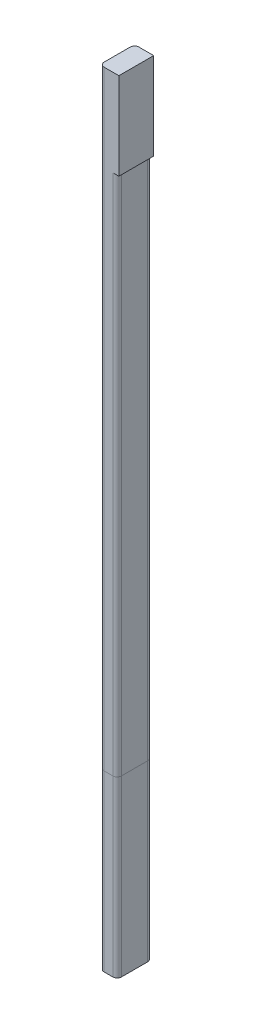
ISO-10303-21;
HEADER;
FILE_DESCRIPTION(('STEP AP214'),'2;1');
FILE_NAME('part.step','',(''),(''),'','','');
FILE_SCHEMA(('AUTOMOTIVE_DESIGN { 1 0 10303 214 1 1 1 1 }'));
ENDSEC;
DATA;
#1=APPLICATION_CONTEXT('core data for automotive mechanical design processes');
#2=APPLICATION_PROTOCOL_DEFINITION('international standard','automotive_design',2000,#1);
#3=PRODUCT_CONTEXT('',#1,'mechanical');
#4=PRODUCT('Part','Part','',(#3));
#5=PRODUCT_RELATED_PRODUCT_CATEGORY('part','',(#4));
#6=PRODUCT_DEFINITION_FORMATION('','',#4);
#7=PRODUCT_DEFINITION_CONTEXT('part definition',#1,'design');
#8=PRODUCT_DEFINITION('design','',#6,#7);
#9=PRODUCT_DEFINITION_SHAPE('','',#8);
#10=(LENGTH_UNIT() NAMED_UNIT(*) SI_UNIT(.MILLI.,.METRE.));
#11=(NAMED_UNIT(*) PLANE_ANGLE_UNIT() SI_UNIT($,.RADIAN.));
#12=(NAMED_UNIT(*) SI_UNIT($,.STERADIAN.) SOLID_ANGLE_UNIT());
#13=UNCERTAINTY_MEASURE_WITH_UNIT(LENGTH_MEASURE(1.E-05),#10,'distance_accuracy_value','');
#14=(GEOMETRIC_REPRESENTATION_CONTEXT(3) GLOBAL_UNCERTAINTY_ASSIGNED_CONTEXT((#13)) GLOBAL_UNIT_ASSIGNED_CONTEXT((#10,
#11,#12)) REPRESENTATION_CONTEXT('',''));
#15=CARTESIAN_POINT('',(0.,0.,0.));
#16=DIRECTION('',(0.,0.,1.));
#17=DIRECTION('',(1.,0.,0.));
#18=AXIS2_PLACEMENT_3D('',#15,#16,#17);
#19=CARTESIAN_POINT('',(0.,0.,0.));
#20=DIRECTION('',(0.,-1.,0.));
#21=DIRECTION('',(0.,0.,-1.));
#22=AXIS2_PLACEMENT_3D('',#19,#20,#21);
#23=PLANE('',#22);
#24=DIRECTION('',(0.,0.,1.));
#25=VECTOR('',#24,1.);
#26=CARTESIAN_POINT('',(1.,0.,-1.5));
#27=LINE('',#26,#25);
#28=CARTESIAN_POINT('',(1.,0.,-1.5));
#29=VERTEX_POINT('',#28);
#30=CARTESIAN_POINT('',(1.,0.,1.5));
#31=VERTEX_POINT('',#30);
#32=EDGE_CURVE('E212',#29,#31,#27,.T.);
#33=ORIENTED_EDGE('',*,*,#32,.T.);
#34=CARTESIAN_POINT('',(0.5,0.,1.5));
#35=DIRECTION('',(0.,-1.,0.));
#36=DIRECTION('',(0.,0.,-1.));
#37=AXIS2_PLACEMENT_3D('',#34,#35,#36);
#38=CIRCLE('',#37,0.5);
#39=CARTESIAN_POINT('',(0.5,0.,2.));
#40=VERTEX_POINT('',#39);
#41=EDGE_CURVE('E228',#31,#40,#38,.T.);
#42=ORIENTED_EDGE('',*,*,#41,.T.);
#43=DIRECTION('',(-1.,0.,0.));
#44=VECTOR('',#43,1.);
#45=CARTESIAN_POINT('',(0.5,0.,2.));
#46=LINE('',#45,#44);
#47=CARTESIAN_POINT('',(-0.5,0.,2.));
#48=VERTEX_POINT('',#47);
#49=EDGE_CURVE('E194',#40,#48,#46,.T.);
#50=ORIENTED_EDGE('',*,*,#49,.T.);
#51=CARTESIAN_POINT('',(-0.5,0.,1.5));
#52=DIRECTION('',(0.,-1.,0.));
#53=DIRECTION('',(0.,0.,-1.));
#54=AXIS2_PLACEMENT_3D('',#51,#52,#53);
#55=CIRCLE('',#54,0.5);
#56=CARTESIAN_POINT('',(-1.,0.,1.5));
#57=VERTEX_POINT('',#56);
#58=EDGE_CURVE('E226',#48,#57,#55,.T.);
#59=ORIENTED_EDGE('',*,*,#58,.T.);
#60=DIRECTION('',(0.,0.,-1.));
#61=VECTOR('',#60,1.);
#62=CARTESIAN_POINT('',(-1.,0.,-1.5));
#63=LINE('',#62,#61);
#64=CARTESIAN_POINT('',(-1.,0.,-1.5));
#65=VERTEX_POINT('',#64);
#66=EDGE_CURVE('E352',#57,#65,#63,.T.);
#67=ORIENTED_EDGE('',*,*,#66,.T.);
#68=CARTESIAN_POINT('',(-0.5,0.,-1.5));
#69=DIRECTION('',(0.,-1.,0.));
#70=DIRECTION('',(0.,0.,-1.));
#71=AXIS2_PLACEMENT_3D('',#68,#69,#70);
#72=CIRCLE('',#71,0.5);
#73=CARTESIAN_POINT('',(-0.5,0.,-2.));
#74=VERTEX_POINT('',#73);
#75=EDGE_CURVE('E222',#65,#74,#72,.T.);
#76=ORIENTED_EDGE('',*,*,#75,.T.);
#77=DIRECTION('',(1.,0.,0.));
#78=VECTOR('',#77,1.);
#79=CARTESIAN_POINT('',(0.5,0.,-2.));
#80=LINE('',#79,#78);
#81=CARTESIAN_POINT('',(0.5,0.,-2.));
#82=VERTEX_POINT('',#81);
#83=EDGE_CURVE('E213',#74,#82,#80,.T.);
#84=ORIENTED_EDGE('',*,*,#83,.T.);
#85=CARTESIAN_POINT('',(0.5,0.,-1.5));
#86=DIRECTION('',(0.,-1.,0.));
#87=DIRECTION('',(0.,0.,-1.));
#88=AXIS2_PLACEMENT_3D('',#85,#86,#87);
#89=CIRCLE('',#88,0.5);
#90=EDGE_CURVE('E224',#82,#29,#89,.T.);
#91=ORIENTED_EDGE('',*,*,#90,.T.);
#92=EDGE_LOOP('',(#33,#42,#50,#59,#67,#76,#84,#91));
#93=FACE_BOUND('',#92,.T.);
#94=ADVANCED_FACE('F73',(#93),#23,.T.);
#95=CARTESIAN_POINT('',(0.,20.,0.));
#96=DIRECTION('',(0.,-1.,0.));
#97=DIRECTION('',(0.,0.,-1.));
#98=AXIS2_PLACEMENT_3D('',#95,#96,#97);
#99=PLANE('',#98);
#100=DIRECTION('',(-1.,0.,0.));
#101=VECTOR('',#100,1.);
#102=CARTESIAN_POINT('',(0.5,20.,2.));
#103=LINE('',#102,#101);
#104=CARTESIAN_POINT('',(0.5,20.,2.));
#105=VERTEX_POINT('',#104);
#106=CARTESIAN_POINT('',(-0.5,20.,2.));
#107=VERTEX_POINT('',#106);
#108=EDGE_CURVE('E191',#105,#107,#103,.T.);
#109=ORIENTED_EDGE('',*,*,#108,.F.);
#110=CARTESIAN_POINT('',(0.5,20.,1.5));
#111=DIRECTION('',(0.,-1.,0.));
#112=DIRECTION('',(0.,0.,-1.));
#113=AXIS2_PLACEMENT_3D('',#110,#111,#112);
#114=CIRCLE('',#113,0.5);
#115=CARTESIAN_POINT('',(1.,20.,1.5));
#116=VERTEX_POINT('',#115);
#117=EDGE_CURVE('E174',#105,#116,#114,.F.);
#118=ORIENTED_EDGE('',*,*,#117,.T.);
#119=DIRECTION('',(0.,0.,1.));
#120=VECTOR('',#119,1.);
#121=CARTESIAN_POINT('',(1.,20.,-1.5));
#122=LINE('',#121,#120);
#123=CARTESIAN_POINT('',(1.,20.,-1.5));
#124=VERTEX_POINT('',#123);
#125=EDGE_CURVE('E201',#124,#116,#122,.T.);
#126=ORIENTED_EDGE('',*,*,#125,.F.);
#127=CARTESIAN_POINT('',(0.5,20.,-1.5));
#128=DIRECTION('',(0.,-1.,0.));
#129=DIRECTION('',(0.,0.,-1.));
#130=AXIS2_PLACEMENT_3D('',#127,#128,#129);
#131=CIRCLE('',#130,0.5);
#132=CARTESIAN_POINT('',(0.5,20.,-2.));
#133=VERTEX_POINT('',#132);
#134=EDGE_CURVE('E216',#124,#133,#131,.F.);
#135=ORIENTED_EDGE('',*,*,#134,.T.);
#136=DIRECTION('',(1.,0.,0.));
#137=VECTOR('',#136,1.);
#138=CARTESIAN_POINT('',(0.5,20.,-2.));
#139=LINE('',#138,#137);
#140=CARTESIAN_POINT('',(-0.5,20.,-2.));
#141=VERTEX_POINT('',#140);
#142=EDGE_CURVE('E204',#141,#133,#139,.T.);
#143=ORIENTED_EDGE('',*,*,#142,.F.);
#144=CARTESIAN_POINT('',(-0.5,20.,-1.5));
#145=DIRECTION('',(0.,-1.,0.));
#146=DIRECTION('',(0.,0.,-1.));
#147=AXIS2_PLACEMENT_3D('',#144,#145,#146);
#148=CIRCLE('',#147,0.5);
#149=CARTESIAN_POINT('',(-1.,20.,-1.5));
#150=VERTEX_POINT('',#149);
#151=EDGE_CURVE('E195',#141,#150,#148,.F.);
#152=ORIENTED_EDGE('',*,*,#151,.T.);
#153=DIRECTION('',(0.,0.,-1.));
#154=VECTOR('',#153,1.);
#155=CARTESIAN_POINT('',(-1.,20.,-1.5));
#156=LINE('',#155,#154);
#157=CARTESIAN_POINT('',(-1.,20.,1.5));
#158=VERTEX_POINT('',#157);
#159=EDGE_CURVE('E200',#158,#150,#156,.T.);
#160=ORIENTED_EDGE('',*,*,#159,.F.);
#161=CARTESIAN_POINT('',(-0.5,20.,1.5));
#162=DIRECTION('',(0.,-1.,0.));
#163=DIRECTION('',(0.,0.,-1.));
#164=AXIS2_PLACEMENT_3D('',#161,#162,#163);
#165=CIRCLE('',#164,0.5);
#166=EDGE_CURVE('E185',#158,#107,#165,.F.);
#167=ORIENTED_EDGE('',*,*,#166,.T.);
#168=EDGE_LOOP('',(#109,#118,#126,#135,#143,#152,#160,#167));
#169=FACE_BOUND('',#168,.T.);
#170=DIRECTION('',(0.,0.,-1.));
#171=VECTOR('',#170,1.);
#172=CARTESIAN_POINT('',(-0.5,20.,-1.5));
#173=LINE('',#172,#171);
#174=CARTESIAN_POINT('',(-0.5,20.,1.));
#175=VERTEX_POINT('',#174);
#176=CARTESIAN_POINT('',(-0.5,20.,-1.));
#177=VERTEX_POINT('',#176);
#178=EDGE_CURVE('E206',#175,#177,#173,.T.);
#179=ORIENTED_EDGE('',*,*,#178,.T.);
#180=CARTESIAN_POINT('',(0.,20.,-1.));
#181=DIRECTION('',(0.,-1.,0.));
#182=DIRECTION('',(0.,0.,-1.));
#183=AXIS2_PLACEMENT_3D('',#180,#181,#182);
#184=CIRCLE('',#183,0.5);
#185=CARTESIAN_POINT('',(0.,20.,-1.5));
#186=VERTEX_POINT('',#185);
#187=EDGE_CURVE('E13',#177,#186,#184,.T.);
#188=ORIENTED_EDGE('',*,*,#187,.T.);
#189=CARTESIAN_POINT('',(0.,20.,-1.));
#190=DIRECTION('',(0.,-1.,0.));
#191=DIRECTION('',(0.,0.,-1.));
#192=AXIS2_PLACEMENT_3D('',#189,#190,#191);
#193=CIRCLE('',#192,0.5);
#194=CARTESIAN_POINT('',(0.5,20.,-1.));
#195=VERTEX_POINT('',#194);
#196=EDGE_CURVE('E259',#186,#195,#193,.T.);
#197=ORIENTED_EDGE('',*,*,#196,.T.);
#198=DIRECTION('',(0.,0.,1.));
#199=VECTOR('',#198,1.);
#200=CARTESIAN_POINT('',(0.5,20.,-1.5));
#201=LINE('',#200,#199);
#202=CARTESIAN_POINT('',(0.5,20.,1.));
#203=VERTEX_POINT('',#202);
#204=EDGE_CURVE('E294',#195,#203,#201,.T.);
#205=ORIENTED_EDGE('',*,*,#204,.T.);
#206=CARTESIAN_POINT('',(0.,20.,1.));
#207=DIRECTION('',(0.,-1.,0.));
#208=DIRECTION('',(0.,0.,-1.));
#209=AXIS2_PLACEMENT_3D('',#206,#207,#208);
#210=CIRCLE('',#209,0.5);
#211=CARTESIAN_POINT('',(0.,20.,1.5));
#212=VERTEX_POINT('',#211);
#213=EDGE_CURVE('E95',#203,#212,#210,.T.);
#214=ORIENTED_EDGE('',*,*,#213,.T.);
#215=CARTESIAN_POINT('',(0.,20.,1.));
#216=DIRECTION('',(0.,-1.,0.));
#217=DIRECTION('',(0.,0.,-1.));
#218=AXIS2_PLACEMENT_3D('',#215,#216,#217);
#219=CIRCLE('',#218,0.5);
#220=EDGE_CURVE('E82',#212,#175,#219,.T.);
#221=ORIENTED_EDGE('',*,*,#220,.T.);
#222=EDGE_LOOP('',(#179,#188,#197,#205,#214,#221));
#223=FACE_BOUND('',#222,.T.);
#224=ADVANCED_FACE('F198',(#169,#223),#99,.F.);
#225=CARTESIAN_POINT('',(1.,0.,-1.5));
#226=DIRECTION('',(-1.,0.,0.));
#227=DIRECTION('',(0.,0.,1.));
#228=AXIS2_PLACEMENT_3D('',#225,#226,#227);
#229=PLANE('',#228);
#230=ORIENTED_EDGE('',*,*,#125,.T.);
#231=DIRECTION('',(0.,1.,0.));
#232=VECTOR('',#231,1.);
#233=CARTESIAN_POINT('',(1.,0.,1.5));
#234=LINE('',#233,#232);
#235=EDGE_CURVE('E179',#116,#31,#234,.F.);
#236=ORIENTED_EDGE('',*,*,#235,.T.);
#237=ORIENTED_EDGE('',*,*,#32,.F.);
#238=DIRECTION('',(0.,1.,0.));
#239=VECTOR('',#238,1.);
#240=CARTESIAN_POINT('',(1.,0.,-1.5));
#241=LINE('',#240,#239);
#242=EDGE_CURVE('E184',#29,#124,#241,.T.);
#243=ORIENTED_EDGE('',*,*,#242,.T.);
#244=EDGE_LOOP('',(#230,#236,#237,#243));
#245=FACE_BOUND('',#244,.T.);
#246=ADVANCED_FACE('F312',(#245),#229,.F.);
#247=CARTESIAN_POINT('',(0.5,0.,2.));
#248=DIRECTION('',(0.,0.,-1.));
#249=DIRECTION('',(-1.,0.,0.));
#250=AXIS2_PLACEMENT_3D('',#247,#248,#249);
#251=PLANE('',#250);
#252=ORIENTED_EDGE('',*,*,#49,.F.);
#253=DIRECTION('',(0.,1.,0.));
#254=VECTOR('',#253,1.);
#255=CARTESIAN_POINT('',(0.5,0.,2.));
#256=LINE('',#255,#254);
#257=EDGE_CURVE('E178',#40,#105,#256,.T.);
#258=ORIENTED_EDGE('',*,*,#257,.T.);
#259=ORIENTED_EDGE('',*,*,#108,.T.);
#260=DIRECTION('',(0.,1.,0.));
#261=VECTOR('',#260,1.);
#262=CARTESIAN_POINT('',(-0.5,0.,2.));
#263=LINE('',#262,#261);
#264=EDGE_CURVE('E196',#107,#48,#263,.F.);
#265=ORIENTED_EDGE('',*,*,#264,.T.);
#266=EDGE_LOOP('',(#252,#258,#259,#265));
#267=FACE_BOUND('',#266,.T.);
#268=ADVANCED_FACE('F190',(#267),#251,.F.);
#269=CARTESIAN_POINT('',(-1.,0.,-1.5));
#270=DIRECTION('',(1.,0.,0.));
#271=DIRECTION('',(0.,0.,-1.));
#272=AXIS2_PLACEMENT_3D('',#269,#270,#271);
#273=PLANE('',#272);
#274=ORIENTED_EDGE('',*,*,#66,.F.);
#275=DIRECTION('',(0.,1.,0.));
#276=VECTOR('',#275,1.);
#277=CARTESIAN_POINT('',(-1.,0.,1.5));
#278=LINE('',#277,#276);
#279=EDGE_CURVE('E232',#57,#158,#278,.T.);
#280=ORIENTED_EDGE('',*,*,#279,.T.);
#281=ORIENTED_EDGE('',*,*,#159,.T.);
#282=DIRECTION('',(0.,1.,0.));
#283=VECTOR('',#282,1.);
#284=CARTESIAN_POINT('',(-1.,0.,-1.5));
#285=LINE('',#284,#283);
#286=EDGE_CURVE('E230',#150,#65,#285,.F.);
#287=ORIENTED_EDGE('',*,*,#286,.T.);
#288=EDGE_LOOP('',(#274,#280,#281,#287));
#289=FACE_BOUND('',#288,.T.);
#290=ADVANCED_FACE('F321',(#289),#273,.F.);
#291=CARTESIAN_POINT('',(0.5,0.,-2.));
#292=DIRECTION('',(0.,0.,1.));
#293=DIRECTION('',(1.,0.,0.));
#294=AXIS2_PLACEMENT_3D('',#291,#292,#293);
#295=PLANE('',#294);
#296=ORIENTED_EDGE('',*,*,#142,.T.);
#297=DIRECTION('',(0.,1.,0.));
#298=VECTOR('',#297,1.);
#299=CARTESIAN_POINT('',(0.5,0.,-2.));
#300=LINE('',#299,#298);
#301=EDGE_CURVE('E238',#133,#82,#300,.F.);
#302=ORIENTED_EDGE('',*,*,#301,.T.);
#303=ORIENTED_EDGE('',*,*,#83,.F.);
#304=DIRECTION('',(0.,1.,0.));
#305=VECTOR('',#304,1.);
#306=CARTESIAN_POINT('',(-0.5,0.,-2.));
#307=LINE('',#306,#305);
#308=EDGE_CURVE('E235',#74,#141,#307,.T.);
#309=ORIENTED_EDGE('',*,*,#308,.T.);
#310=EDGE_LOOP('',(#296,#302,#303,#309));
#311=FACE_BOUND('',#310,.T.);
#312=ADVANCED_FACE('F318',(#311),#295,.F.);
#313=CARTESIAN_POINT('',(0.5,0.,-1.5));
#314=DIRECTION('',(-1.,0.,0.));
#315=DIRECTION('',(0.,0.,1.));
#316=AXIS2_PLACEMENT_3D('',#313,#314,#315);
#317=PLANE('',#316);
#318=DIRECTION('',(0.,0.,1.));
#319=VECTOR('',#318,1.);
#320=CARTESIAN_POINT('',(0.5,0.5,-1.5));
#321=LINE('',#320,#319);
#322=CARTESIAN_POINT('',(0.5,0.5,-1.));
#323=VERTEX_POINT('',#322);
#324=CARTESIAN_POINT('',(0.5,0.5,1.));
#325=VERTEX_POINT('',#324);
#326=EDGE_CURVE('E268',#323,#325,#321,.T.);
#327=ORIENTED_EDGE('',*,*,#326,.T.);
#328=DIRECTION('',(0.,1.,0.));
#329=VECTOR('',#328,1.);
#330=CARTESIAN_POINT('',(0.5,20.,1.));
#331=LINE('',#330,#329);
#332=EDGE_CURVE('E243',#325,#203,#331,.T.);
#333=ORIENTED_EDGE('',*,*,#332,.T.);
#334=ORIENTED_EDGE('',*,*,#204,.F.);
#335=DIRECTION('',(0.,1.,0.));
#336=VECTOR('',#335,1.);
#337=CARTESIAN_POINT('',(0.5,0.5,-1.));
#338=LINE('',#337,#336);
#339=EDGE_CURVE('E240',#195,#323,#338,.F.);
#340=ORIENTED_EDGE('',*,*,#339,.T.);
#341=EDGE_LOOP('',(#327,#333,#334,#340));
#342=FACE_BOUND('',#341,.T.);
#343=ADVANCED_FACE('F292',(#342),#317,.T.);
#344=CARTESIAN_POINT('',(-0.5,0.,-1.5));
#345=DIRECTION('',(1.,0.,0.));
#346=DIRECTION('',(0.,0.,-1.));
#347=AXIS2_PLACEMENT_3D('',#344,#345,#346);
#348=PLANE('',#347);
#349=ORIENTED_EDGE('',*,*,#178,.F.);
#350=DIRECTION('',(0.,1.,0.));
#351=VECTOR('',#350,1.);
#352=CARTESIAN_POINT('',(-0.5,0.5,1.));
#353=LINE('',#352,#351);
#354=CARTESIAN_POINT('',(-0.5,0.5,1.));
#355=VERTEX_POINT('',#354);
#356=EDGE_CURVE('E256',#175,#355,#353,.F.);
#357=ORIENTED_EDGE('',*,*,#356,.T.);
#358=DIRECTION('',(0.,0.,-1.));
#359=VECTOR('',#358,1.);
#360=CARTESIAN_POINT('',(-0.5,0.5,-1.5));
#361=LINE('',#360,#359);
#362=CARTESIAN_POINT('',(-0.5,0.5,-1.));
#363=VERTEX_POINT('',#362);
#364=EDGE_CURVE('E263',#355,#363,#361,.T.);
#365=ORIENTED_EDGE('',*,*,#364,.T.);
#366=DIRECTION('',(0.,1.,0.));
#367=VECTOR('',#366,1.);
#368=CARTESIAN_POINT('',(-0.5,20.,-1.));
#369=LINE('',#368,#367);
#370=EDGE_CURVE('E254',#363,#177,#369,.T.);
#371=ORIENTED_EDGE('',*,*,#370,.T.);
#372=EDGE_LOOP('',(#349,#357,#365,#371));
#373=FACE_BOUND('',#372,.T.);
#374=ADVANCED_FACE('F285',(#373),#348,.T.);
#375=CARTESIAN_POINT('',(0.,0.5,0.));
#376=DIRECTION('',(0.,1.,0.));
#377=DIRECTION('',(0.,0.,1.));
#378=AXIS2_PLACEMENT_3D('',#375,#376,#377);
#379=PLANE('',#378);
#380=CARTESIAN_POINT('',(0.,0.5,1.));
#381=DIRECTION('',(0.,1.,0.));
#382=DIRECTION('',(0.,0.,1.));
#383=AXIS2_PLACEMENT_3D('',#380,#381,#382);
#384=CIRCLE('',#383,0.5);
#385=CARTESIAN_POINT('',(0.,0.5,1.5));
#386=VERTEX_POINT('',#385);
#387=EDGE_CURVE('E250',#355,#386,#384,.T.);
#388=ORIENTED_EDGE('',*,*,#387,.T.);
#389=CARTESIAN_POINT('',(0.,0.5,1.));
#390=DIRECTION('',(0.,1.,0.));
#391=DIRECTION('',(0.,0.,1.));
#392=AXIS2_PLACEMENT_3D('',#389,#390,#391);
#393=CIRCLE('',#392,0.5);
#394=EDGE_CURVE('E252',#386,#325,#393,.T.);
#395=ORIENTED_EDGE('',*,*,#394,.T.);
#396=ORIENTED_EDGE('',*,*,#326,.F.);
#397=CARTESIAN_POINT('',(0.,0.5,-1.));
#398=DIRECTION('',(0.,1.,0.));
#399=DIRECTION('',(0.,0.,1.));
#400=AXIS2_PLACEMENT_3D('',#397,#398,#399);
#401=CIRCLE('',#400,0.5);
#402=CARTESIAN_POINT('',(0.,0.5,-1.5));
#403=VERTEX_POINT('',#402);
#404=EDGE_CURVE('E248',#323,#403,#401,.T.);
#405=ORIENTED_EDGE('',*,*,#404,.T.);
#406=CARTESIAN_POINT('',(0.,0.5,-1.));
#407=DIRECTION('',(0.,1.,0.));
#408=DIRECTION('',(0.,0.,1.));
#409=AXIS2_PLACEMENT_3D('',#406,#407,#408);
#410=CIRCLE('',#409,0.5);
#411=EDGE_CURVE('E246',#403,#363,#410,.T.);
#412=ORIENTED_EDGE('',*,*,#411,.T.);
#413=ORIENTED_EDGE('',*,*,#364,.F.);
#414=EDGE_LOOP('',(#388,#395,#396,#405,#412,#413));
#415=FACE_BOUND('',#414,.T.);
#416=ADVANCED_FACE('F280',(#415),#379,.T.);
#417=CARTESIAN_POINT('',(0.5,0.,1.5));
#418=DIRECTION('',(0.,1.,0.));
#419=DIRECTION('',(0.,0.,1.));
#420=AXIS2_PLACEMENT_3D('',#417,#418,#419);
#421=CYLINDRICAL_SURFACE('',#420,0.5);
#422=ORIENTED_EDGE('',*,*,#41,.F.);
#423=ORIENTED_EDGE('',*,*,#235,.F.);
#424=ORIENTED_EDGE('',*,*,#117,.F.);
#425=ORIENTED_EDGE('',*,*,#257,.F.);
#426=EDGE_LOOP('',(#422,#423,#424,#425));
#427=FACE_BOUND('',#426,.T.);
#428=ADVANCED_FACE('F177',(#427),#421,.T.);
#429=CARTESIAN_POINT('',(-0.5,0.,1.5));
#430=DIRECTION('',(0.,1.,0.));
#431=DIRECTION('',(0.,0.,1.));
#432=AXIS2_PLACEMENT_3D('',#429,#430,#431);
#433=CYLINDRICAL_SURFACE('',#432,0.5);
#434=ORIENTED_EDGE('',*,*,#58,.F.);
#435=ORIENTED_EDGE('',*,*,#264,.F.);
#436=ORIENTED_EDGE('',*,*,#166,.F.);
#437=ORIENTED_EDGE('',*,*,#279,.F.);
#438=EDGE_LOOP('',(#434,#435,#436,#437));
#439=FACE_BOUND('',#438,.T.);
#440=ADVANCED_FACE('F333',(#439),#433,.T.);
#441=CARTESIAN_POINT('',(0.5,0.,-1.5));
#442=DIRECTION('',(0.,1.,0.));
#443=DIRECTION('',(0.,0.,1.));
#444=AXIS2_PLACEMENT_3D('',#441,#442,#443);
#445=CYLINDRICAL_SURFACE('',#444,0.5);
#446=ORIENTED_EDGE('',*,*,#90,.F.);
#447=ORIENTED_EDGE('',*,*,#301,.F.);
#448=ORIENTED_EDGE('',*,*,#134,.F.);
#449=ORIENTED_EDGE('',*,*,#242,.F.);
#450=EDGE_LOOP('',(#446,#447,#448,#449));
#451=FACE_BOUND('',#450,.T.);
#452=ADVANCED_FACE('F336',(#451),#445,.T.);
#453=CARTESIAN_POINT('',(-0.5,0.,-1.5));
#454=DIRECTION('',(0.,1.,0.));
#455=DIRECTION('',(0.,0.,1.));
#456=AXIS2_PLACEMENT_3D('',#453,#454,#455);
#457=CYLINDRICAL_SURFACE('',#456,0.5);
#458=ORIENTED_EDGE('',*,*,#75,.F.);
#459=ORIENTED_EDGE('',*,*,#286,.F.);
#460=ORIENTED_EDGE('',*,*,#151,.F.);
#461=ORIENTED_EDGE('',*,*,#308,.F.);
#462=EDGE_LOOP('',(#458,#459,#460,#461));
#463=FACE_BOUND('',#462,.T.);
#464=ADVANCED_FACE('F303',(#463),#457,.T.);
#465=CARTESIAN_POINT('',(0.,0.,1.));
#466=DIRECTION('',(0.,-1.,0.));
#467=DIRECTION('',(0.,0.,-1.));
#468=AXIS2_PLACEMENT_3D('',#465,#466,#467);
#469=CYLINDRICAL_SURFACE('',#468,0.5);
#470=DIRECTION('',(0.,1.,0.));
#471=VECTOR('',#470,1.);
#472=CARTESIAN_POINT('',(0.,20.,1.5));
#473=LINE('',#472,#471);
#474=EDGE_CURVE('E261',#386,#212,#473,.T.);
#475=ORIENTED_EDGE('',*,*,#474,.F.);
#476=ORIENTED_EDGE('',*,*,#387,.F.);
#477=ORIENTED_EDGE('',*,*,#356,.F.);
#478=ORIENTED_EDGE('',*,*,#220,.F.);
#479=EDGE_LOOP('',(#475,#476,#477,#478));
#480=FACE_BOUND('',#479,.T.);
#481=ADVANCED_FACE('F288',(#480),#469,.F.);
#482=CARTESIAN_POINT('',(0.,0.,1.));
#483=DIRECTION('',(0.,-1.,0.));
#484=DIRECTION('',(0.,0.,-1.));
#485=AXIS2_PLACEMENT_3D('',#482,#483,#484);
#486=CYLINDRICAL_SURFACE('',#485,0.5);
#487=ORIENTED_EDGE('',*,*,#394,.F.);
#488=ORIENTED_EDGE('',*,*,#474,.T.);
#489=ORIENTED_EDGE('',*,*,#213,.F.);
#490=ORIENTED_EDGE('',*,*,#332,.F.);
#491=EDGE_LOOP('',(#487,#488,#489,#490));
#492=FACE_BOUND('',#491,.T.);
#493=ADVANCED_FACE('F296',(#492),#486,.F.);
#494=CARTESIAN_POINT('',(0.,0.,-1.));
#495=DIRECTION('',(0.,-1.,0.));
#496=DIRECTION('',(0.,0.,-1.));
#497=AXIS2_PLACEMENT_3D('',#494,#495,#496);
#498=CYLINDRICAL_SURFACE('',#497,0.5);
#499=ORIENTED_EDGE('',*,*,#370,.F.);
#500=ORIENTED_EDGE('',*,*,#411,.F.);
#501=DIRECTION('',(0.,1.,0.));
#502=VECTOR('',#501,1.);
#503=CARTESIAN_POINT('',(0.,0.5,-1.5));
#504=LINE('',#503,#502);
#505=EDGE_CURVE('E77',#186,#403,#504,.F.);
#506=ORIENTED_EDGE('',*,*,#505,.F.);
#507=ORIENTED_EDGE('',*,*,#187,.F.);
#508=EDGE_LOOP('',(#499,#500,#506,#507));
#509=FACE_BOUND('',#508,.T.);
#510=ADVANCED_FACE('F75',(#509),#498,.F.);
#511=CARTESIAN_POINT('',(0.,0.,-1.));
#512=DIRECTION('',(0.,-1.,0.));
#513=DIRECTION('',(0.,0.,-1.));
#514=AXIS2_PLACEMENT_3D('',#511,#512,#513);
#515=CYLINDRICAL_SURFACE('',#514,0.5);
#516=ORIENTED_EDGE('',*,*,#404,.F.);
#517=ORIENTED_EDGE('',*,*,#339,.F.);
#518=ORIENTED_EDGE('',*,*,#196,.F.);
#519=ORIENTED_EDGE('',*,*,#505,.T.);
#520=EDGE_LOOP('',(#516,#517,#518,#519));
#521=FACE_BOUND('',#520,.T.);
#522=ADVANCED_FACE('F273',(#521),#515,.F.);
#523=CLOSED_SHELL('',(#94,#224,#246,#268,#290,#312,#343,#374,#416,#428,#440,#452,#464,#481,#493,
#510,#522));
#524=MANIFOLD_SOLID_BREP('B2',#523);
#525=CARTESIAN_POINT('',(1.,90.,1.5));
#526=DIRECTION('',(-1.,0.,0.));
#527=DIRECTION('',(0.,0.,1.));
#528=AXIS2_PLACEMENT_3D('',#525,#526,#527);
#529=PLANE('',#528);
#530=DIRECTION('',(0.,0.,1.));
#531=VECTOR('',#530,1.);
#532=CARTESIAN_POINT('',(1.,20.,-2.));
#533=LINE('',#532,#531);
#534=CARTESIAN_POINT('',(1.,20.,-1.5));
#535=VERTEX_POINT('',#534);
#536=CARTESIAN_POINT('',(1.,20.,1.5));
#537=VERTEX_POINT('',#536);
#538=EDGE_CURVE('E733',#535,#537,#533,.T.);
#539=ORIENTED_EDGE('',*,*,#538,.F.);
#540=DIRECTION('',(0.,-1.,0.));
#541=VECTOR('',#540,1.);
#542=CARTESIAN_POINT('',(1.,90.,-1.5));
#543=LINE('',#542,#541);
#544=CARTESIAN_POINT('',(1.,80.,-1.5));
#545=VERTEX_POINT('',#544);
#546=EDGE_CURVE('E694',#535,#545,#543,.F.);
#547=ORIENTED_EDGE('',*,*,#546,.T.);
#548=DIRECTION('',(0.,0.,-1.));
#549=VECTOR('',#548,1.);
#550=CARTESIAN_POINT('',(1.,80.,-2.));
#551=LINE('',#550,#549);
#552=CARTESIAN_POINT('',(1.,80.,1.5));
#553=VERTEX_POINT('',#552);
#554=EDGE_CURVE('E615',#553,#545,#551,.T.);
#555=ORIENTED_EDGE('',*,*,#554,.F.);
#556=DIRECTION('',(0.,-1.,0.));
#557=VECTOR('',#556,1.);
#558=CARTESIAN_POINT('',(1.,90.,1.5));
#559=LINE('',#558,#557);
#560=EDGE_CURVE('E690',#553,#537,#559,.T.);
#561=ORIENTED_EDGE('',*,*,#560,.T.);
#562=EDGE_LOOP('',(#539,#547,#555,#561));
#563=FACE_BOUND('',#562,.T.);
#564=ADVANCED_FACE('F471',(#563),#529,.F.);
#565=CARTESIAN_POINT('',(-1.,90.,1.5));
#566=DIRECTION('',(1.,0.,0.));
#567=DIRECTION('',(0.,0.,-1.));
#568=AXIS2_PLACEMENT_3D('',#565,#566,#567);
#569=PLANE('',#568);
#570=DIRECTION('',(0.,0.,-1.));
#571=VECTOR('',#570,1.);
#572=CARTESIAN_POINT('',(-1.,20.,1.5));
#573=LINE('',#572,#571);
#574=CARTESIAN_POINT('',(-1.,20.,1.5));
#575=VERTEX_POINT('',#574);
#576=CARTESIAN_POINT('',(-1.,20.,-1.5));
#577=VERTEX_POINT('',#576);
#578=EDGE_CURVE('E619',#575,#577,#573,.T.);
#579=ORIENTED_EDGE('',*,*,#578,.F.);
#580=DIRECTION('',(0.,-1.,0.));
#581=VECTOR('',#580,1.);
#582=CARTESIAN_POINT('',(-1.,90.,1.5));
#583=LINE('',#582,#581);
#584=CARTESIAN_POINT('',(-1.,90.,1.5));
#585=VERTEX_POINT('',#584);
#586=EDGE_CURVE('E709',#575,#585,#583,.F.);
#587=ORIENTED_EDGE('',*,*,#586,.T.);
#588=DIRECTION('',(0.,0.,1.));
#589=VECTOR('',#588,1.);
#590=CARTESIAN_POINT('',(-1.,90.,1.5));
#591=LINE('',#590,#589);
#592=CARTESIAN_POINT('',(-1.,90.,-1.5));
#593=VERTEX_POINT('',#592);
#594=EDGE_CURVE('E642',#593,#585,#591,.T.);
#595=ORIENTED_EDGE('',*,*,#594,.F.);
#596=DIRECTION('',(0.,-1.,0.));
#597=VECTOR('',#596,1.);
#598=CARTESIAN_POINT('',(-1.,90.,-1.5));
#599=LINE('',#598,#597);
#600=EDGE_CURVE('E705',#593,#577,#599,.T.);
#601=ORIENTED_EDGE('',*,*,#600,.T.);
#602=EDGE_LOOP('',(#579,#587,#595,#601));
#603=FACE_BOUND('',#602,.T.);
#604=ADVANCED_FACE('F778',(#603),#569,.F.);
#605=CARTESIAN_POINT('',(0.5,90.,2.));
#606=DIRECTION('',(0.,0.,-1.));
#607=DIRECTION('',(-1.,0.,0.));
#608=AXIS2_PLACEMENT_3D('',#605,#606,#607);
#609=PLANE('',#608);
#610=DIRECTION('',(-1.,0.,0.));
#611=VECTOR('',#610,1.);
#612=CARTESIAN_POINT('',(1.,20.,2.));
#613=LINE('',#612,#611);
#614=CARTESIAN_POINT('',(0.500000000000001,20.,2.));
#615=VERTEX_POINT('',#614);
#616=CARTESIAN_POINT('',(-0.499999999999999,20.,2.));
#617=VERTEX_POINT('',#616);
#618=EDGE_CURVE('E740',#615,#617,#613,.T.);
#619=ORIENTED_EDGE('',*,*,#618,.F.);
#620=DIRECTION('',(0.,-1.,0.));
#621=VECTOR('',#620,1.);
#622=CARTESIAN_POINT('',(0.5,90.,2.));
#623=LINE('',#622,#621);
#624=CARTESIAN_POINT('',(0.5,80.,2.));
#625=VERTEX_POINT('',#624);
#626=EDGE_CURVE('E701',#615,#625,#623,.F.);
#627=ORIENTED_EDGE('',*,*,#626,.T.);
#628=DIRECTION('',(-1.,0.,0.));
#629=VECTOR('',#628,1.);
#630=CARTESIAN_POINT('',(1.2,80.,2.));
#631=LINE('',#630,#629);
#632=CARTESIAN_POINT('',(1.2,80.,2.));
#633=VERTEX_POINT('',#632);
#634=EDGE_CURVE('E631',#633,#625,#631,.T.);
#635=ORIENTED_EDGE('',*,*,#634,.F.);
#636=DIRECTION('',(0.,-1.,0.));
#637=VECTOR('',#636,1.);
#638=CARTESIAN_POINT('',(1.2,90.,2.));
#639=LINE('',#638,#637);
#640=CARTESIAN_POINT('',(1.2,90.,2.));
#641=VERTEX_POINT('',#640);
#642=EDGE_CURVE('E608',#641,#633,#639,.T.);
#643=ORIENTED_EDGE('',*,*,#642,.F.);
#644=DIRECTION('',(1.,0.,0.));
#645=VECTOR('',#644,1.);
#646=CARTESIAN_POINT('',(0.5,90.,2.));
#647=LINE('',#646,#645);
#648=CARTESIAN_POINT('',(-0.5,90.,2.));
#649=VERTEX_POINT('',#648);
#650=EDGE_CURVE('E598',#649,#641,#647,.T.);
#651=ORIENTED_EDGE('',*,*,#650,.F.);
#652=DIRECTION('',(0.,-1.,0.));
#653=VECTOR('',#652,1.);
#654=CARTESIAN_POINT('',(-0.5,90.,2.));
#655=LINE('',#654,#653);
#656=EDGE_CURVE('E697',#649,#617,#655,.T.);
#657=ORIENTED_EDGE('',*,*,#656,.T.);
#658=EDGE_LOOP('',(#619,#627,#635,#643,#651,#657));
#659=FACE_BOUND('',#658,.T.);
#660=ADVANCED_FACE('F784',(#659),#609,.F.);
#661=CARTESIAN_POINT('',(0.5,90.,-2.));
#662=DIRECTION('',(0.,0.,1.));
#663=DIRECTION('',(1.,0.,0.));
#664=AXIS2_PLACEMENT_3D('',#661,#662,#663);
#665=PLANE('',#664);
#666=DIRECTION('',(-1.,0.,0.));
#667=VECTOR('',#666,1.);
#668=CARTESIAN_POINT('',(1.2,80.,-2.));
#669=LINE('',#668,#667);
#670=CARTESIAN_POINT('',(1.2,80.,-2.));
#671=VERTEX_POINT('',#670);
#672=CARTESIAN_POINT('',(0.5,80.,-2.));
#673=VERTEX_POINT('',#672);
#674=EDGE_CURVE('E627',#671,#673,#669,.T.);
#675=ORIENTED_EDGE('',*,*,#674,.T.);
#676=DIRECTION('',(0.,-1.,0.));
#677=VECTOR('',#676,1.);
#678=CARTESIAN_POINT('',(0.5,90.,-2.));
#679=LINE('',#678,#677);
#680=CARTESIAN_POINT('',(0.500000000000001,20.,-2.));
#681=VERTEX_POINT('',#680);
#682=EDGE_CURVE('E674',#673,#681,#679,.T.);
#683=ORIENTED_EDGE('',*,*,#682,.T.);
#684=DIRECTION('',(1.,0.,0.));
#685=VECTOR('',#684,1.);
#686=CARTESIAN_POINT('',(1.,20.,-2.));
#687=LINE('',#686,#685);
#688=CARTESIAN_POINT('',(-0.499999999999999,20.,-2.));
#689=VERTEX_POINT('',#688);
#690=EDGE_CURVE('E803',#689,#681,#687,.T.);
#691=ORIENTED_EDGE('',*,*,#690,.F.);
#692=DIRECTION('',(0.,-1.,0.));
#693=VECTOR('',#692,1.);
#694=CARTESIAN_POINT('',(-0.5,90.,-2.));
#695=LINE('',#694,#693);
#696=CARTESIAN_POINT('',(-0.5,90.,-2.));
#697=VERTEX_POINT('',#696);
#698=EDGE_CURVE('E593',#689,#697,#695,.F.);
#699=ORIENTED_EDGE('',*,*,#698,.T.);
#700=DIRECTION('',(-1.,0.,0.));
#701=VECTOR('',#700,1.);
#702=CARTESIAN_POINT('',(0.5,90.,-2.));
#703=LINE('',#702,#701);
#704=CARTESIAN_POINT('',(1.2,90.,-2.));
#705=VERTEX_POINT('',#704);
#706=EDGE_CURVE('E586',#705,#697,#703,.T.);
#707=ORIENTED_EDGE('',*,*,#706,.F.);
#708=DIRECTION('',(0.,1.,0.));
#709=VECTOR('',#708,1.);
#710=CARTESIAN_POINT('',(1.2,90.,-2.));
#711=LINE('',#710,#709);
#712=EDGE_CURVE('E590',#671,#705,#711,.T.);
#713=ORIENTED_EDGE('',*,*,#712,.F.);
#714=EDGE_LOOP('',(#675,#683,#691,#699,#707,#713));
#715=FACE_BOUND('',#714,.T.);
#716=ADVANCED_FACE('F588',(#715),#665,.F.);
#717=CARTESIAN_POINT('',(0.,90.,0.));
#718=DIRECTION('',(0.,1.,0.));
#719=DIRECTION('',(0.,0.,1.));
#720=AXIS2_PLACEMENT_3D('',#717,#718,#719);
#721=PLANE('',#720);
#722=ORIENTED_EDGE('',*,*,#594,.T.);
#723=CARTESIAN_POINT('',(-0.5,90.,1.5));
#724=DIRECTION('',(0.,1.,0.));
#725=DIRECTION('',(0.,0.,1.));
#726=AXIS2_PLACEMENT_3D('',#723,#724,#725);
#727=CIRCLE('',#726,0.5);
#728=EDGE_CURVE('E715',#585,#649,#727,.T.);
#729=ORIENTED_EDGE('',*,*,#728,.T.);
#730=ORIENTED_EDGE('',*,*,#650,.T.);
#731=DIRECTION('',(0.,0.,1.));
#732=VECTOR('',#731,1.);
#733=CARTESIAN_POINT('',(1.2,90.,-2.));
#734=LINE('',#733,#732);
#735=EDGE_CURVE('E601',#705,#641,#734,.T.);
#736=ORIENTED_EDGE('',*,*,#735,.F.);
#737=ORIENTED_EDGE('',*,*,#706,.T.);
#738=CARTESIAN_POINT('',(-0.5,90.,-1.5));
#739=DIRECTION('',(0.,1.,0.));
#740=DIRECTION('',(0.,0.,1.));
#741=AXIS2_PLACEMENT_3D('',#738,#739,#740);
#742=CIRCLE('',#741,0.5);
#743=EDGE_CURVE('E712',#697,#593,#742,.T.);
#744=ORIENTED_EDGE('',*,*,#743,.T.);
#745=EDGE_LOOP('',(#722,#729,#730,#736,#737,#744));
#746=FACE_BOUND('',#745,.T.);
#747=ADVANCED_FACE('F603',(#746),#721,.T.);
#748=CARTESIAN_POINT('',(1.2,80.,-2.));
#749=DIRECTION('',(0.,1.,0.));
#750=DIRECTION('',(0.,0.,1.));
#751=AXIS2_PLACEMENT_3D('',#748,#749,#750);
#752=PLANE('',#751);
#753=ORIENTED_EDGE('',*,*,#634,.T.);
#754=CARTESIAN_POINT('',(0.5,80.,1.5));
#755=DIRECTION('',(0.,1.,0.));
#756=DIRECTION('',(0.,0.,1.));
#757=AXIS2_PLACEMENT_3D('',#754,#755,#756);
#758=CIRCLE('',#757,0.5);
#759=EDGE_CURVE('E71',#625,#553,#758,.T.);
#760=ORIENTED_EDGE('',*,*,#759,.T.);
#761=ORIENTED_EDGE('',*,*,#554,.T.);
#762=CARTESIAN_POINT('',(0.5,80.,-1.5));
#763=DIRECTION('',(0.,1.,0.));
#764=DIRECTION('',(0.,0.,1.));
#765=AXIS2_PLACEMENT_3D('',#762,#763,#764);
#766=CIRCLE('',#765,0.5);
#767=EDGE_CURVE('E481',#545,#673,#766,.T.);
#768=ORIENTED_EDGE('',*,*,#767,.T.);
#769=ORIENTED_EDGE('',*,*,#674,.F.);
#770=DIRECTION('',(0.,0.,-1.));
#771=VECTOR('',#770,1.);
#772=CARTESIAN_POINT('',(1.2,80.,-2.));
#773=LINE('',#772,#771);
#774=EDGE_CURVE('E612',#633,#671,#773,.T.);
#775=ORIENTED_EDGE('',*,*,#774,.F.);
#776=EDGE_LOOP('',(#753,#760,#761,#768,#769,#775));
#777=FACE_BOUND('',#776,.T.);
#778=ADVANCED_FACE('F810',(#777),#752,.F.);
#779=CARTESIAN_POINT('',(1.2,0.,0.));
#780=DIRECTION('',(-1.,0.,0.));
#781=DIRECTION('',(0.,0.,1.));
#782=AXIS2_PLACEMENT_3D('',#779,#780,#781);
#783=PLANE('',#782);
#784=ORIENTED_EDGE('',*,*,#712,.T.);
#785=ORIENTED_EDGE('',*,*,#735,.T.);
#786=ORIENTED_EDGE('',*,*,#642,.T.);
#787=ORIENTED_EDGE('',*,*,#774,.T.);
#788=EDGE_LOOP('',(#784,#785,#786,#787));
#789=FACE_BOUND('',#788,.T.);
#790=ADVANCED_FACE('F610',(#789),#783,.F.);
#791=CARTESIAN_POINT('',(0.,20.,0.));
#792=DIRECTION('',(0.,-1.,0.));
#793=DIRECTION('',(0.,0.,-1.));
#794=AXIS2_PLACEMENT_3D('',#791,#792,#793);
#795=PLANE('',#794);
#796=CARTESIAN_POINT('',(0.,20.,1.));
#797=DIRECTION('',(0.,-1.,0.));
#798=DIRECTION('',(0.,0.,-1.));
#799=AXIS2_PLACEMENT_3D('',#796,#797,#798);
#800=CIRCLE('',#799,0.5);
#801=CARTESIAN_POINT('',(-0.5,20.,1.));
#802=VERTEX_POINT('',#801);
#803=CARTESIAN_POINT('',(0.,20.,1.5));
#804=VERTEX_POINT('',#803);
#805=EDGE_CURVE('E496',#802,#804,#800,.F.);
#806=ORIENTED_EDGE('',*,*,#805,.T.);
#807=CARTESIAN_POINT('',(0.,20.,1.));
#808=DIRECTION('',(0.,-1.,0.));
#809=DIRECTION('',(0.,0.,-1.));
#810=AXIS2_PLACEMENT_3D('',#807,#808,#809);
#811=CIRCLE('',#810,0.5);
#812=CARTESIAN_POINT('',(0.5,20.,1.));
#813=VERTEX_POINT('',#812);
#814=EDGE_CURVE('E720',#804,#813,#811,.F.);
#815=ORIENTED_EDGE('',*,*,#814,.T.);
#816=DIRECTION('',(0.,0.,1.));
#817=VECTOR('',#816,1.);
#818=CARTESIAN_POINT('',(0.5,20.,1.5));
#819=LINE('',#818,#817);
#820=CARTESIAN_POINT('',(0.5,20.,-1.));
#821=VERTEX_POINT('',#820);
#822=EDGE_CURVE('E760',#821,#813,#819,.T.);
#823=ORIENTED_EDGE('',*,*,#822,.F.);
#824=CARTESIAN_POINT('',(0.,20.,-1.));
#825=DIRECTION('',(0.,-1.,0.));
#826=DIRECTION('',(0.,0.,-1.));
#827=AXIS2_PLACEMENT_3D('',#824,#825,#826);
#828=CIRCLE('',#827,0.5);
#829=CARTESIAN_POINT('',(0.,20.,-1.5));
#830=VERTEX_POINT('',#829);
#831=EDGE_CURVE('E489',#821,#830,#828,.F.);
#832=ORIENTED_EDGE('',*,*,#831,.T.);
#833=CARTESIAN_POINT('',(0.,20.,-1.));
#834=DIRECTION('',(0.,-1.,0.));
#835=DIRECTION('',(0.,0.,-1.));
#836=AXIS2_PLACEMENT_3D('',#833,#834,#835);
#837=CIRCLE('',#836,0.5);
#838=CARTESIAN_POINT('',(-0.5,20.,-1.));
#839=VERTEX_POINT('',#838);
#840=EDGE_CURVE('E723',#830,#839,#837,.F.);
#841=ORIENTED_EDGE('',*,*,#840,.T.);
#842=DIRECTION('',(0.,0.,-1.));
#843=VECTOR('',#842,1.);
#844=CARTESIAN_POINT('',(-0.5,20.,1.5));
#845=LINE('',#844,#843);
#846=EDGE_CURVE('E822',#802,#839,#845,.T.);
#847=ORIENTED_EDGE('',*,*,#846,.F.);
#848=EDGE_LOOP('',(#806,#815,#823,#832,#841,#847));
#849=FACE_BOUND('',#848,.T.);
#850=ORIENTED_EDGE('',*,*,#690,.T.);
#851=CARTESIAN_POINT('',(0.5,20.,-1.5));
#852=DIRECTION('',(0.,-1.,0.));
#853=DIRECTION('',(0.,0.,-1.));
#854=AXIS2_PLACEMENT_3D('',#851,#852,#853);
#855=CIRCLE('',#854,0.5);
#856=EDGE_CURVE('E687',#681,#535,#855,.T.);
#857=ORIENTED_EDGE('',*,*,#856,.T.);
#858=ORIENTED_EDGE('',*,*,#538,.T.);
#859=CARTESIAN_POINT('',(0.5,20.,1.5));
#860=DIRECTION('',(0.,-1.,0.));
#861=DIRECTION('',(0.,0.,-1.));
#862=AXIS2_PLACEMENT_3D('',#859,#860,#861);
#863=CIRCLE('',#862,0.5);
#864=EDGE_CURVE('E684',#537,#615,#863,.T.);
#865=ORIENTED_EDGE('',*,*,#864,.T.);
#866=ORIENTED_EDGE('',*,*,#618,.T.);
#867=CARTESIAN_POINT('',(-0.5,20.,1.5));
#868=DIRECTION('',(0.,-1.,0.));
#869=DIRECTION('',(0.,0.,-1.));
#870=AXIS2_PLACEMENT_3D('',#867,#868,#869);
#871=CIRCLE('',#870,0.5);
#872=EDGE_CURVE('E681',#617,#575,#871,.T.);
#873=ORIENTED_EDGE('',*,*,#872,.T.);
#874=ORIENTED_EDGE('',*,*,#578,.T.);
#875=CARTESIAN_POINT('',(-0.5,20.,-1.5));
#876=DIRECTION('',(0.,-1.,0.));
#877=DIRECTION('',(0.,0.,-1.));
#878=AXIS2_PLACEMENT_3D('',#875,#876,#877);
#879=CIRCLE('',#878,0.5);
#880=EDGE_CURVE('E678',#577,#689,#879,.T.);
#881=ORIENTED_EDGE('',*,*,#880,.T.);
#882=EDGE_LOOP('',(#850,#857,#858,#865,#866,#873,#874,#881));
#883=FACE_BOUND('',#882,.T.);
#884=ADVANCED_FACE('F817',(#849,#883),#795,.T.);
#885=CARTESIAN_POINT('',(-0.5,89.,1.5));
#886=DIRECTION('',(1.,0.,0.));
#887=DIRECTION('',(0.,0.,-1.));
#888=AXIS2_PLACEMENT_3D('',#885,#886,#887);
#889=PLANE('',#888);
#890=DIRECTION('',(0.,0.,1.));
#891=VECTOR('',#890,1.);
#892=CARTESIAN_POINT('',(-0.5,89.,1.5));
#893=LINE('',#892,#891);
#894=CARTESIAN_POINT('',(-0.5,89.,-1.));
#895=VERTEX_POINT('',#894);
#896=CARTESIAN_POINT('',(-0.5,89.,1.));
#897=VERTEX_POINT('',#896);
#898=EDGE_CURVE('E634',#895,#897,#893,.T.);
#899=ORIENTED_EDGE('',*,*,#898,.T.);
#900=DIRECTION('',(0.,-1.,0.));
#901=VECTOR('',#900,1.);
#902=CARTESIAN_POINT('',(-0.5,20.,1.));
#903=LINE('',#902,#901);
#904=EDGE_CURVE('E650',#897,#802,#903,.T.);
#905=ORIENTED_EDGE('',*,*,#904,.T.);
#906=ORIENTED_EDGE('',*,*,#846,.T.);
#907=DIRECTION('',(0.,-1.,0.));
#908=VECTOR('',#907,1.);
#909=CARTESIAN_POINT('',(-0.5,89.,-1.));
#910=LINE('',#909,#908);
#911=EDGE_CURVE('E597',#839,#895,#910,.F.);
#912=ORIENTED_EDGE('',*,*,#911,.T.);
#913=EDGE_LOOP('',(#899,#905,#906,#912));
#914=FACE_BOUND('',#913,.T.);
#915=ADVANCED_FACE('F765',(#914),#889,.T.);
#916=CARTESIAN_POINT('',(0.5,89.,1.5));
#917=DIRECTION('',(-1.,0.,0.));
#918=DIRECTION('',(0.,0.,1.));
#919=AXIS2_PLACEMENT_3D('',#916,#917,#918);
#920=PLANE('',#919);
#921=ORIENTED_EDGE('',*,*,#822,.T.);
#922=DIRECTION('',(0.,-1.,0.));
#923=VECTOR('',#922,1.);
#924=CARTESIAN_POINT('',(0.5,89.,1.));
#925=LINE('',#924,#923);
#926=CARTESIAN_POINT('',(0.5,89.,1.));
#927=VERTEX_POINT('',#926);
#928=EDGE_CURVE('E669',#813,#927,#925,.F.);
#929=ORIENTED_EDGE('',*,*,#928,.T.);
#930=DIRECTION('',(0.,0.,-1.));
#931=VECTOR('',#930,1.);
#932=CARTESIAN_POINT('',(0.5,89.,1.5));
#933=LINE('',#932,#931);
#934=CARTESIAN_POINT('',(0.5,89.,-1.));
#935=VERTEX_POINT('',#934);
#936=EDGE_CURVE('E638',#927,#935,#933,.T.);
#937=ORIENTED_EDGE('',*,*,#936,.T.);
#938=DIRECTION('',(0.,-1.,0.));
#939=VECTOR('',#938,1.);
#940=CARTESIAN_POINT('',(0.5,20.,-1.));
#941=LINE('',#940,#939);
#942=EDGE_CURVE('E666',#935,#821,#941,.T.);
#943=ORIENTED_EDGE('',*,*,#942,.T.);
#944=EDGE_LOOP('',(#921,#929,#937,#943));
#945=FACE_BOUND('',#944,.T.);
#946=ADVANCED_FACE('F758',(#945),#920,.T.);
#947=CARTESIAN_POINT('',(0.,89.,0.));
#948=DIRECTION('',(0.,1.,0.));
#949=DIRECTION('',(0.,0.,1.));
#950=AXIS2_PLACEMENT_3D('',#947,#948,#949);
#951=PLANE('',#950);
#952=CARTESIAN_POINT('',(0.,89.,1.));
#953=DIRECTION('',(0.,1.,0.));
#954=DIRECTION('',(0.,0.,1.));
#955=AXIS2_PLACEMENT_3D('',#952,#953,#954);
#956=CIRCLE('',#955,0.5);
#957=CARTESIAN_POINT('',(0.,89.,1.5));
#958=VERTEX_POINT('',#957);
#959=EDGE_CURVE('E660',#927,#958,#956,.F.);
#960=ORIENTED_EDGE('',*,*,#959,.T.);
#961=CARTESIAN_POINT('',(0.,89.,1.));
#962=DIRECTION('',(0.,1.,0.));
#963=DIRECTION('',(0.,0.,1.));
#964=AXIS2_PLACEMENT_3D('',#961,#962,#963);
#965=CIRCLE('',#964,0.5);
#966=EDGE_CURVE('E663',#958,#897,#965,.F.);
#967=ORIENTED_EDGE('',*,*,#966,.T.);
#968=ORIENTED_EDGE('',*,*,#898,.F.);
#969=CARTESIAN_POINT('',(0.,89.,-1.));
#970=DIRECTION('',(0.,1.,0.));
#971=DIRECTION('',(0.,0.,1.));
#972=AXIS2_PLACEMENT_3D('',#969,#970,#971);
#973=CIRCLE('',#972,0.5);
#974=CARTESIAN_POINT('',(0.,89.,-1.5));
#975=VERTEX_POINT('',#974);
#976=EDGE_CURVE('E657',#895,#975,#973,.F.);
#977=ORIENTED_EDGE('',*,*,#976,.T.);
#978=CARTESIAN_POINT('',(0.,89.,-1.));
#979=DIRECTION('',(0.,1.,0.));
#980=DIRECTION('',(0.,0.,1.));
#981=AXIS2_PLACEMENT_3D('',#978,#979,#980);
#982=CIRCLE('',#981,0.5);
#983=EDGE_CURVE('E654',#975,#935,#982,.F.);
#984=ORIENTED_EDGE('',*,*,#983,.T.);
#985=ORIENTED_EDGE('',*,*,#936,.F.);
#986=EDGE_LOOP('',(#960,#967,#968,#977,#984,#985));
#987=FACE_BOUND('',#986,.T.);
#988=ADVANCED_FACE('F753',(#987),#951,.F.);
#989=CARTESIAN_POINT('',(0.,89.,1.));
#990=DIRECTION('',(0.,1.,0.));
#991=DIRECTION('',(0.,0.,1.));
#992=AXIS2_PLACEMENT_3D('',#989,#990,#991);
#993=CYLINDRICAL_SURFACE('',#992,0.5);
#994=DIRECTION('',(0.,-1.,0.));
#995=VECTOR('',#994,1.);
#996=CARTESIAN_POINT('',(0.,20.,1.5));
#997=LINE('',#996,#995);
#998=EDGE_CURVE('E730',#958,#804,#997,.T.);
#999=ORIENTED_EDGE('',*,*,#998,.F.);
#1000=ORIENTED_EDGE('',*,*,#959,.F.);
#1001=ORIENTED_EDGE('',*,*,#928,.F.);
#1002=ORIENTED_EDGE('',*,*,#814,.F.);
#1003=EDGE_LOOP('',(#999,#1000,#1001,#1002));
#1004=FACE_BOUND('',#1003,.T.);
#1005=ADVANCED_FACE('F762',(#1004),#993,.F.);
#1006=CARTESIAN_POINT('',(0.,89.,1.));
#1007=DIRECTION('',(0.,1.,0.));
#1008=DIRECTION('',(0.,0.,1.));
#1009=AXIS2_PLACEMENT_3D('',#1006,#1007,#1008);
#1010=CYLINDRICAL_SURFACE('',#1009,0.5);
#1011=ORIENTED_EDGE('',*,*,#966,.F.);
#1012=ORIENTED_EDGE('',*,*,#998,.T.);
#1013=ORIENTED_EDGE('',*,*,#805,.F.);
#1014=ORIENTED_EDGE('',*,*,#904,.F.);
#1015=EDGE_LOOP('',(#1011,#1012,#1013,#1014));
#1016=FACE_BOUND('',#1015,.T.);
#1017=ADVANCED_FACE('F767',(#1016),#1010,.F.);
#1018=CARTESIAN_POINT('',(0.,89.,-1.));
#1019=DIRECTION('',(0.,1.,0.));
#1020=DIRECTION('',(0.,0.,1.));
#1021=AXIS2_PLACEMENT_3D('',#1018,#1019,#1020);
#1022=CYLINDRICAL_SURFACE('',#1021,0.5);
#1023=ORIENTED_EDGE('',*,*,#942,.F.);
#1024=ORIENTED_EDGE('',*,*,#983,.F.);
#1025=DIRECTION('',(0.,-1.,0.));
#1026=VECTOR('',#1025,1.);
#1027=CARTESIAN_POINT('',(0.,89.,-1.5));
#1028=LINE('',#1027,#1026);
#1029=EDGE_CURVE('E475',#830,#975,#1028,.F.);
#1030=ORIENTED_EDGE('',*,*,#1029,.F.);
#1031=ORIENTED_EDGE('',*,*,#831,.F.);
#1032=EDGE_LOOP('',(#1023,#1024,#1030,#1031));
#1033=FACE_BOUND('',#1032,.T.);
#1034=ADVANCED_FACE('F750',(#1033),#1022,.F.);
#1035=CARTESIAN_POINT('',(0.,89.,-1.));
#1036=DIRECTION('',(0.,1.,0.));
#1037=DIRECTION('',(0.,0.,1.));
#1038=AXIS2_PLACEMENT_3D('',#1035,#1036,#1037);
#1039=CYLINDRICAL_SURFACE('',#1038,0.5);
#1040=ORIENTED_EDGE('',*,*,#976,.F.);
#1041=ORIENTED_EDGE('',*,*,#911,.F.);
#1042=ORIENTED_EDGE('',*,*,#840,.F.);
#1043=ORIENTED_EDGE('',*,*,#1029,.T.);
#1044=EDGE_LOOP('',(#1040,#1041,#1042,#1043));
#1045=FACE_BOUND('',#1044,.T.);
#1046=ADVANCED_FACE('F745',(#1045),#1039,.F.);
#1047=CARTESIAN_POINT('',(0.5,90.,-1.5));
#1048=DIRECTION('',(0.,-1.,0.));
#1049=DIRECTION('',(0.,0.,-1.));
#1050=AXIS2_PLACEMENT_3D('',#1047,#1048,#1049);
#1051=CYLINDRICAL_SURFACE('',#1050,0.5);
#1052=ORIENTED_EDGE('',*,*,#767,.F.);
#1053=ORIENTED_EDGE('',*,*,#546,.F.);
#1054=ORIENTED_EDGE('',*,*,#856,.F.);
#1055=ORIENTED_EDGE('',*,*,#682,.F.);
#1056=EDGE_LOOP('',(#1052,#1053,#1054,#1055));
#1057=FACE_BOUND('',#1056,.T.);
#1058=ADVANCED_FACE('F814',(#1057),#1051,.T.);
#1059=CARTESIAN_POINT('',(0.5,90.,1.5));
#1060=DIRECTION('',(0.,-1.,0.));
#1061=DIRECTION('',(0.,0.,-1.));
#1062=AXIS2_PLACEMENT_3D('',#1059,#1060,#1061);
#1063=CYLINDRICAL_SURFACE('',#1062,0.5);
#1064=ORIENTED_EDGE('',*,*,#759,.F.);
#1065=ORIENTED_EDGE('',*,*,#626,.F.);
#1066=ORIENTED_EDGE('',*,*,#864,.F.);
#1067=ORIENTED_EDGE('',*,*,#560,.F.);
#1068=EDGE_LOOP('',(#1064,#1065,#1066,#1067));
#1069=FACE_BOUND('',#1068,.T.);
#1070=ADVANCED_FACE('F806',(#1069),#1063,.T.);
#1071=CARTESIAN_POINT('',(-0.5,90.,1.5));
#1072=DIRECTION('',(0.,-1.,0.));
#1073=DIRECTION('',(0.,0.,-1.));
#1074=AXIS2_PLACEMENT_3D('',#1071,#1072,#1073);
#1075=CYLINDRICAL_SURFACE('',#1074,0.5);
#1076=ORIENTED_EDGE('',*,*,#728,.F.);
#1077=ORIENTED_EDGE('',*,*,#586,.F.);
#1078=ORIENTED_EDGE('',*,*,#872,.F.);
#1079=ORIENTED_EDGE('',*,*,#656,.F.);
#1080=EDGE_LOOP('',(#1076,#1077,#1078,#1079));
#1081=FACE_BOUND('',#1080,.T.);
#1082=ADVANCED_FACE('F832',(#1081),#1075,.T.);
#1083=CARTESIAN_POINT('',(-0.5,90.,-1.5));
#1084=DIRECTION('',(0.,-1.,0.));
#1085=DIRECTION('',(0.,0.,-1.));
#1086=AXIS2_PLACEMENT_3D('',#1083,#1084,#1085);
#1087=CYLINDRICAL_SURFACE('',#1086,0.5);
#1088=ORIENTED_EDGE('',*,*,#743,.F.);
#1089=ORIENTED_EDGE('',*,*,#698,.F.);
#1090=ORIENTED_EDGE('',*,*,#880,.F.);
#1091=ORIENTED_EDGE('',*,*,#600,.F.);
#1092=EDGE_LOOP('',(#1088,#1089,#1090,#1091));
#1093=FACE_BOUND('',#1092,.T.);
#1094=ADVANCED_FACE('F473',(#1093),#1087,.T.);
#1095=CLOSED_SHELL('',(#564,#604,#660,#716,#747,#778,#790,#884,#915,#946,#988,#1005,#1017,#1034,
#1046,#1058,#1070,#1082,#1094));
#1096=MANIFOLD_SOLID_BREP('B7',#1095);
#1097=ADVANCED_BREP_SHAPE_REPRESENTATION('',(#18,#524,#1096),#14);
#1098=SHAPE_DEFINITION_REPRESENTATION(#9,#1097);
ENDSEC;
END-ISO-10303-21;
